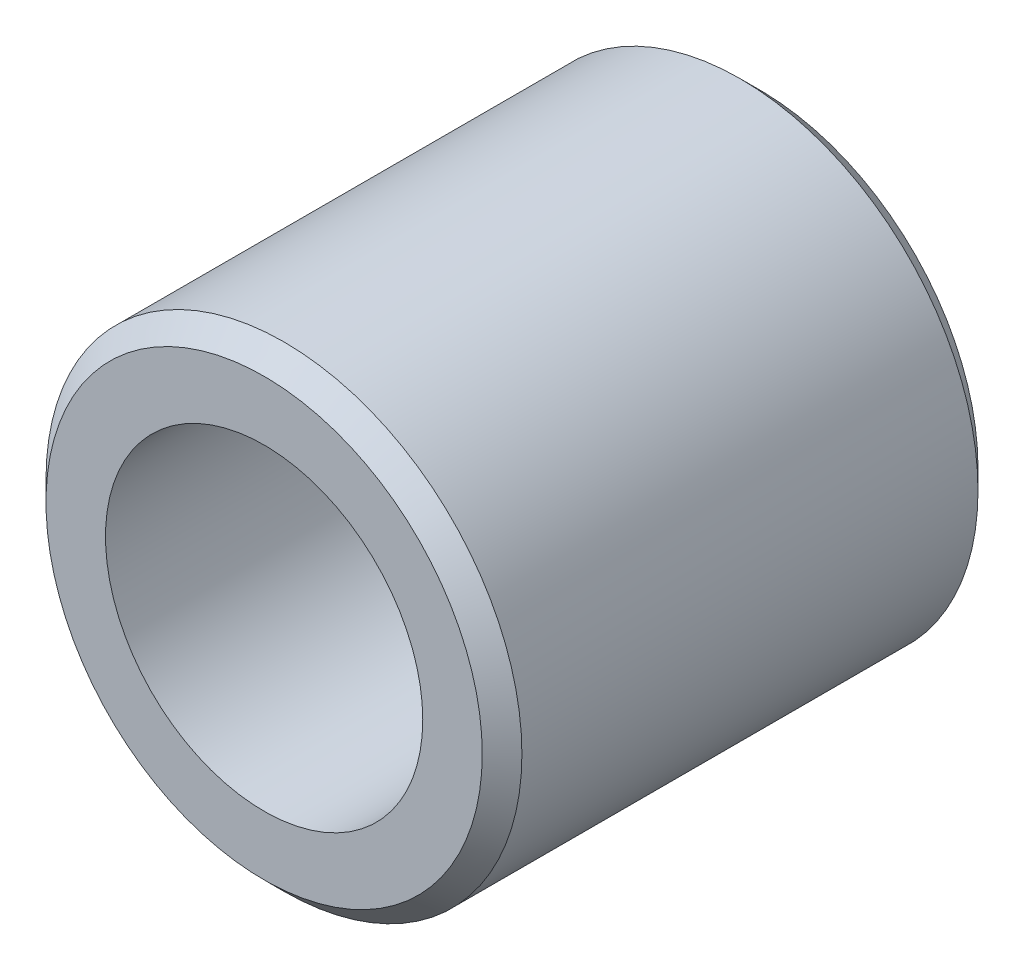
ISO-10303-21;
HEADER;
FILE_DESCRIPTION(('STEP AP214'),'2;1');
FILE_NAME('part.step','',(''),(''),'','','');
FILE_SCHEMA(('AUTOMOTIVE_DESIGN { 1 0 10303 214 1 1 1 1 }'));
ENDSEC;
DATA;
#1=APPLICATION_CONTEXT('core data for automotive mechanical design processes');
#2=APPLICATION_PROTOCOL_DEFINITION('international standard','automotive_design',2000,#1);
#3=PRODUCT_CONTEXT('',#1,'mechanical');
#4=PRODUCT('Part','Part','',(#3));
#5=PRODUCT_RELATED_PRODUCT_CATEGORY('part','',(#4));
#6=PRODUCT_DEFINITION_FORMATION('','',#4);
#7=PRODUCT_DEFINITION_CONTEXT('part definition',#1,'design');
#8=PRODUCT_DEFINITION('design','',#6,#7);
#9=PRODUCT_DEFINITION_SHAPE('','',#8);
#10=(LENGTH_UNIT() NAMED_UNIT(*) SI_UNIT(.MILLI.,.METRE.));
#11=(NAMED_UNIT(*) PLANE_ANGLE_UNIT() SI_UNIT($,.RADIAN.));
#12=(NAMED_UNIT(*) SI_UNIT($,.STERADIAN.) SOLID_ANGLE_UNIT());
#13=UNCERTAINTY_MEASURE_WITH_UNIT(LENGTH_MEASURE(1.E-05),#10,'distance_accuracy_value','');
#14=(GEOMETRIC_REPRESENTATION_CONTEXT(3) GLOBAL_UNCERTAINTY_ASSIGNED_CONTEXT((#13)) GLOBAL_UNIT_ASSIGNED_CONTEXT((#10,
#11,#12)) REPRESENTATION_CONTEXT('',''));
#15=CARTESIAN_POINT('',(0.,0.,0.));
#16=DIRECTION('',(0.,0.,1.));
#17=DIRECTION('',(1.,0.,0.));
#18=AXIS2_PLACEMENT_3D('',#15,#16,#17);
#19=CARTESIAN_POINT('',(0.,0.,12.5));
#20=DIRECTION('',(0.,0.,1.));
#21=DIRECTION('',(1.,0.,0.));
#22=AXIS2_PLACEMENT_3D('',#19,#20,#21);
#23=PLANE('',#22);
#24=CARTESIAN_POINT('',(0.,0.,12.5));
#25=DIRECTION('',(0.,0.,1.));
#26=DIRECTION('',(1.,0.,0.));
#27=AXIS2_PLACEMENT_3D('',#24,#25,#26);
#28=CIRCLE('',#27,5.5);
#29=CARTESIAN_POINT('',(5.5,0.,12.5));
#30=VERTEX_POINT('',#29);
#31=EDGE_CURVE('E10',#30,#30,#28,.T.);
#32=ORIENTED_EDGE('',*,*,#31,.T.);
#33=EDGE_LOOP('',(#32));
#34=FACE_BOUND('',#33,.T.);
#35=CARTESIAN_POINT('',(0.,0.,12.5));
#36=DIRECTION('',(0.,0.,1.));
#37=DIRECTION('',(1.,0.,0.));
#38=AXIS2_PLACEMENT_3D('',#35,#36,#37);
#39=CIRCLE('',#38,4.);
#40=CARTESIAN_POINT('',(4.,0.,12.5));
#41=VERTEX_POINT('',#40);
#42=EDGE_CURVE('E49',#41,#41,#39,.T.);
#43=ORIENTED_EDGE('',*,*,#42,.F.);
#44=EDGE_LOOP('',(#43));
#45=FACE_BOUND('',#44,.T.);
#46=ADVANCED_FACE('F29',(#34,#45),#23,.T.);
#47=CARTESIAN_POINT('',(0.,0.,0.));
#48=DIRECTION('',(0.,0.,1.));
#49=DIRECTION('',(1.,0.,0.));
#50=AXIS2_PLACEMENT_3D('',#47,#48,#49);
#51=PLANE('',#50);
#52=CARTESIAN_POINT('',(0.,0.,0.));
#53=DIRECTION('',(0.,0.,1.));
#54=DIRECTION('',(1.,0.,0.));
#55=AXIS2_PLACEMENT_3D('',#52,#53,#54);
#56=CIRCLE('',#55,5.5);
#57=CARTESIAN_POINT('',(5.5,0.,0.));
#58=VERTEX_POINT('',#57);
#59=EDGE_CURVE('E36',#58,#58,#56,.F.);
#60=ORIENTED_EDGE('',*,*,#59,.T.);
#61=EDGE_LOOP('',(#60));
#62=FACE_BOUND('',#61,.T.);
#63=CARTESIAN_POINT('',(0.,0.,0.));
#64=DIRECTION('',(0.,0.,1.));
#65=DIRECTION('',(1.,0.,0.));
#66=AXIS2_PLACEMENT_3D('',#63,#64,#65);
#67=CIRCLE('',#66,4.);
#68=CARTESIAN_POINT('',(4.,0.,0.));
#69=VERTEX_POINT('',#68);
#70=EDGE_CURVE('E50',#69,#69,#67,.T.);
#71=ORIENTED_EDGE('',*,*,#70,.T.);
#72=EDGE_LOOP('',(#71));
#73=FACE_BOUND('',#72,.T.);
#74=ADVANCED_FACE('F60',(#62,#73),#51,.F.);
#75=CARTESIAN_POINT('',(0.,0.,12.5));
#76=DIRECTION('',(0.,0.,-1.));
#77=DIRECTION('',(-1.,0.,0.));
#78=AXIS2_PLACEMENT_3D('',#75,#76,#77);
#79=CYLINDRICAL_SURFACE('',#78,6.);
#80=CARTESIAN_POINT('',(0.,0.,0.5));
#81=DIRECTION('',(0.,0.,1.));
#82=DIRECTION('',(1.,0.,0.));
#83=AXIS2_PLACEMENT_3D('',#80,#81,#82);
#84=CIRCLE('',#83,6.);
#85=CARTESIAN_POINT('',(6.,0.,0.5));
#86=VERTEX_POINT('',#85);
#87=EDGE_CURVE('E40',#86,#86,#84,.T.);
#88=ORIENTED_EDGE('',*,*,#87,.T.);
#89=EDGE_LOOP('',(#88));
#90=FACE_BOUND('',#89,.T.);
#91=CARTESIAN_POINT('',(0.,0.,12.));
#92=DIRECTION('',(0.,0.,1.));
#93=DIRECTION('',(1.,0.,0.));
#94=AXIS2_PLACEMENT_3D('',#91,#92,#93);
#95=CIRCLE('',#94,6.);
#96=CARTESIAN_POINT('',(6.,0.,12.));
#97=VERTEX_POINT('',#96);
#98=EDGE_CURVE('E44',#97,#97,#95,.F.);
#99=ORIENTED_EDGE('',*,*,#98,.T.);
#100=EDGE_LOOP('',(#99));
#101=FACE_BOUND('',#100,.T.);
#102=ADVANCED_FACE('F65',(#90,#101),#79,.T.);
#103=CARTESIAN_POINT('',(0.,0.,12.5));
#104=DIRECTION('',(0.,0.,-1.));
#105=DIRECTION('',(-1.,0.,0.));
#106=AXIS2_PLACEMENT_3D('',#103,#104,#105);
#107=CYLINDRICAL_SURFACE('',#106,4.);
#108=ORIENTED_EDGE('',*,*,#42,.T.);
#109=EDGE_LOOP('',(#108));
#110=FACE_BOUND('',#109,.T.);
#111=ORIENTED_EDGE('',*,*,#70,.F.);
#112=EDGE_LOOP('',(#111));
#113=FACE_BOUND('',#112,.T.);
#114=ADVANCED_FACE('F56',(#110,#113),#107,.F.);
#115=CARTESIAN_POINT('',(0.,0.,0.5));
#116=DIRECTION('',(0.,0.,1.));
#117=DIRECTION('',(1.,0.,0.));
#118=AXIS2_PLACEMENT_3D('',#115,#116,#117);
#119=CONICAL_SURFACE('',#118,6.,0.785398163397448);
#120=ORIENTED_EDGE('',*,*,#59,.F.);
#121=EDGE_LOOP('',(#120));
#122=FACE_BOUND('',#121,.T.);
#123=ORIENTED_EDGE('',*,*,#87,.F.);
#124=EDGE_LOOP('',(#123));
#125=FACE_BOUND('',#124,.T.);
#126=ADVANCED_FACE('F71',(#122,#125),#119,.T.);
#127=CARTESIAN_POINT('',(0.,0.,12.5));
#128=DIRECTION('',(0.,0.,-1.));
#129=DIRECTION('',(-1.,0.,0.));
#130=AXIS2_PLACEMENT_3D('',#127,#128,#129);
#131=CONICAL_SURFACE('',#130,5.5,0.785398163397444);
#132=ORIENTED_EDGE('',*,*,#98,.F.);
#133=EDGE_LOOP('',(#132));
#134=FACE_BOUND('',#133,.T.);
#135=ORIENTED_EDGE('',*,*,#31,.F.);
#136=EDGE_LOOP('',(#135));
#137=FACE_BOUND('',#136,.T.);
#138=ADVANCED_FACE('F31',(#134,#137),#131,.T.);
#139=CLOSED_SHELL('',(#46,#74,#102,#114,#126,#138));
#140=MANIFOLD_SOLID_BREP('B2',#139);
#141=ADVANCED_BREP_SHAPE_REPRESENTATION('',(#18,#140),#14);
#142=SHAPE_DEFINITION_REPRESENTATION(#9,#141);
ENDSEC;
END-ISO-10303-21;
